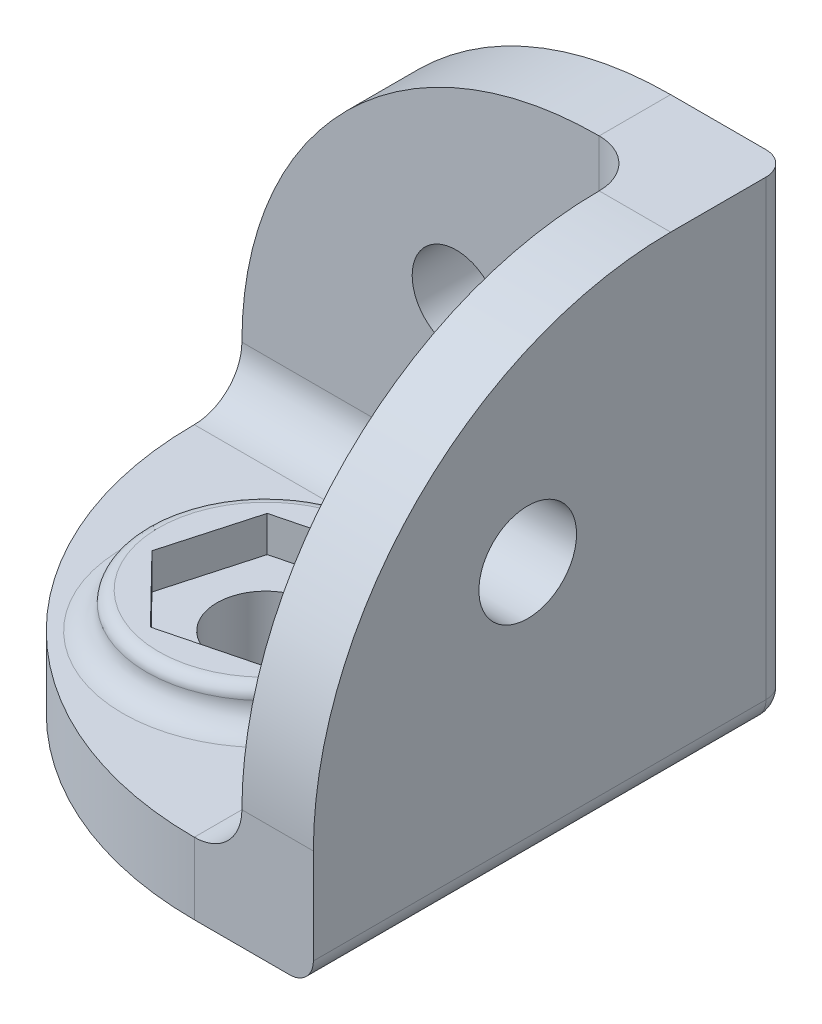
ISO-10303-21;
HEADER;
FILE_DESCRIPTION(('STEP AP214'),'2;1');
FILE_NAME('part.step','',(''),(''),'','','');
FILE_SCHEMA(('AUTOMOTIVE_DESIGN { 1 0 10303 214 1 1 1 1 }'));
ENDSEC;
DATA;
#1=APPLICATION_CONTEXT('core data for automotive mechanical design processes');
#2=APPLICATION_PROTOCOL_DEFINITION('international standard','automotive_design',2000,#1);
#3=PRODUCT_CONTEXT('',#1,'mechanical');
#4=PRODUCT('Part','Part','',(#3));
#5=PRODUCT_RELATED_PRODUCT_CATEGORY('part','',(#4));
#6=PRODUCT_DEFINITION_FORMATION('','',#4);
#7=PRODUCT_DEFINITION_CONTEXT('part definition',#1,'design');
#8=PRODUCT_DEFINITION('design','',#6,#7);
#9=PRODUCT_DEFINITION_SHAPE('','',#8);
#10=(LENGTH_UNIT() NAMED_UNIT(*) SI_UNIT(.MILLI.,.METRE.));
#11=(NAMED_UNIT(*) PLANE_ANGLE_UNIT() SI_UNIT($,.RADIAN.));
#12=(NAMED_UNIT(*) SI_UNIT($,.STERADIAN.) SOLID_ANGLE_UNIT());
#13=UNCERTAINTY_MEASURE_WITH_UNIT(LENGTH_MEASURE(1.E-05),#10,'distance_accuracy_value','');
#14=(GEOMETRIC_REPRESENTATION_CONTEXT(3) GLOBAL_UNCERTAINTY_ASSIGNED_CONTEXT((#13)) GLOBAL_UNIT_ASSIGNED_CONTEXT((#10,
#11,#12)) REPRESENTATION_CONTEXT('',''));
#15=CARTESIAN_POINT('',(0.,0.,0.));
#16=DIRECTION('',(0.,0.,1.));
#17=DIRECTION('',(1.,0.,0.));
#18=AXIS2_PLACEMENT_3D('',#15,#16,#17);
#19=CARTESIAN_POINT('',(2.23280034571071,3.,-2.83720930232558));
#20=DIRECTION('',(0.,1.,0.));
#21=DIRECTION('',(0.,0.,1.));
#22=AXIS2_PLACEMENT_3D('',#19,#20,#21);
#23=PLANE('',#22);
#24=DIRECTION('',(1.,0.,0.));
#25=VECTOR('',#24,1.);
#26=CARTESIAN_POINT('',(2.23280034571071,3.,-2.83720930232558));
#27=LINE('',#26,#25);
#28=CARTESIAN_POINT('',(2.23280034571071,3.,-2.83720930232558));
#29=VERTEX_POINT('',#28);
#30=CARTESIAN_POINT('',(-3.76719965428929,3.,-2.83720930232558));
#31=VERTEX_POINT('',#30);
#32=EDGE_CURVE('E305',#29,#31,#27,.F.);
#33=ORIENTED_EDGE('',*,*,#32,.T.);
#34=CARTESIAN_POINT('',(-3.76719965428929,3.,3.16279069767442));
#35=DIRECTION('',(0.,1.,0.));
#36=DIRECTION('',(0.,0.,1.));
#37=AXIS2_PLACEMENT_3D('',#34,#35,#36);
#38=CIRCLE('',#37,6.);
#39=CARTESIAN_POINT('',(2.23280034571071,3.,3.16279069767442));
#40=VERTEX_POINT('',#39);
#41=EDGE_CURVE('E329',#31,#40,#38,.F.);
#42=ORIENTED_EDGE('',*,*,#41,.T.);
#43=DIRECTION('',(0.,0.,1.));
#44=VECTOR('',#43,1.);
#45=CARTESIAN_POINT('',(2.23280034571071,3.,-2.83720930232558));
#46=LINE('',#45,#44);
#47=EDGE_CURVE('E308',#40,#29,#46,.F.);
#48=ORIENTED_EDGE('',*,*,#47,.T.);
#49=EDGE_LOOP('',(#33,#42,#48));
#50=FACE_BOUND('',#49,.T.);
#51=ADVANCED_FACE('F35',(#50),#23,.T.);
#52=CARTESIAN_POINT('',(2.23280034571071,3.,12.1627906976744));
#53=VERTEX_POINT('',#52);
#54=EDGE_CURVE('E309',#53,#40,#46,.F.);
#55=ORIENTED_EDGE('',*,*,#54,.T.);
#56=CARTESIAN_POINT('',(-3.76719965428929,3.,3.16279069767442));
#57=DIRECTION('',(0.,1.,0.));
#58=DIRECTION('',(0.,0.,1.));
#59=AXIS2_PLACEMENT_3D('',#56,#57,#58);
#60=CIRCLE('',#59,6.);
#61=EDGE_CURVE('E327',#40,#31,#60,.F.);
#62=ORIENTED_EDGE('',*,*,#61,.T.);
#63=CARTESIAN_POINT('',(-12.7671996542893,3.,-2.83720930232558));
#64=VERTEX_POINT('',#63);
#65=EDGE_CURVE('E304',#31,#64,#27,.F.);
#66=ORIENTED_EDGE('',*,*,#65,.T.);
#67=CARTESIAN_POINT('',(2.23280034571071,3.,-2.83720930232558));
#68=DIRECTION('',(0.,1.,0.));
#69=DIRECTION('',(0.,0.,1.));
#70=AXIS2_PLACEMENT_3D('',#67,#68,#69);
#71=CIRCLE('',#70,15.);
#72=EDGE_CURVE('E274',#64,#53,#71,.T.);
#73=ORIENTED_EDGE('',*,*,#72,.T.);
#74=EDGE_LOOP('',(#55,#62,#66,#73));
#75=FACE_BOUND('',#74,.T.);
#76=ADVANCED_FACE('F393',(#75),#23,.T.);
#77=DIRECTION('',(-0.968839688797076,0.,0.247688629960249));
#78=VECTOR('',#77,1.);
#79=CARTESIAN_POINT('',(-2.70751748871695,3.,-0.61747477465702));
#80=LINE('',#79,#78);
#81=CARTESIAN_POINT('',(-2.70751748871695,3.,-0.61747477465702));
#82=VERTEX_POINT('',#81);
#83=CARTESIAN_POINT('',(-6.51116450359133,3.,0.354946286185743));
#84=VERTEX_POINT('',#83);
#85=EDGE_CURVE('E204',#82,#84,#80,.T.);
#86=ORIENTED_EDGE('',*,*,#85,.T.);
#87=DIRECTION('',(-0.269915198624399,0.,0.962884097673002));
#88=VECTOR('',#87,1.);
#89=CARTESIAN_POINT('',(-6.51116450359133,3.,0.354946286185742));
#90=LINE('',#89,#88);
#91=CARTESIAN_POINT('',(-7.57084666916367,3.,4.13521175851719));
#92=VERTEX_POINT('',#91);
#93=EDGE_CURVE('E186',#84,#92,#90,.T.);
#94=ORIENTED_EDGE('',*,*,#93,.T.);
#95=DIRECTION('',(0.698924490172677,0.,0.715195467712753));
#96=VECTOR('',#95,1.);
#97=CARTESIAN_POINT('',(-7.57084666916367,3.,4.13521175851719));
#98=LINE('',#97,#96);
#99=CARTESIAN_POINT('',(-4.82688181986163,3.,6.94305617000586));
#100=VERTEX_POINT('',#99);
#101=EDGE_CURVE('E208',#92,#100,#98,.T.);
#102=ORIENTED_EDGE('',*,*,#101,.T.);
#103=DIRECTION('',(0.968839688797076,0.,-0.247688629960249));
#104=VECTOR('',#103,1.);
#105=CARTESIAN_POINT('',(-4.82688181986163,3.,6.94305617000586));
#106=LINE('',#105,#104);
#107=CARTESIAN_POINT('',(-1.02323480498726,3.,5.9706351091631));
#108=VERTEX_POINT('',#107);
#109=EDGE_CURVE('E210',#100,#108,#106,.T.);
#110=ORIENTED_EDGE('',*,*,#109,.T.);
#111=DIRECTION('',(0.269915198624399,0.,-0.962884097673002));
#112=VECTOR('',#111,1.);
#113=CARTESIAN_POINT('',(-1.02323480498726,3.,5.9706351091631));
#114=LINE('',#113,#112);
#115=CARTESIAN_POINT('',(0.0364473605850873,3.,2.19036963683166));
#116=VERTEX_POINT('',#115);
#117=EDGE_CURVE('E212',#108,#116,#114,.T.);
#118=ORIENTED_EDGE('',*,*,#117,.T.);
#119=DIRECTION('',(-0.698924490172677,0.,-0.715195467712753));
#120=VECTOR('',#119,1.);
#121=CARTESIAN_POINT('',(0.0364473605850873,3.,2.19036963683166));
#122=LINE('',#121,#120);
#123=EDGE_CURVE('E179',#116,#82,#122,.T.);
#124=ORIENTED_EDGE('',*,*,#123,.T.);
#125=EDGE_LOOP('',(#86,#94,#102,#110,#118,#124));
#126=FACE_BOUND('',#125,.T.);
#127=CARTESIAN_POINT('',(-3.76719965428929,3.,3.16279069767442));
#128=DIRECTION('',(0.,1.,0.));
#129=DIRECTION('',(0.,0.,1.));
#130=AXIS2_PLACEMENT_3D('',#127,#128,#129);
#131=CIRCLE('',#130,2.05);
#132=CARTESIAN_POINT('',(-3.76719965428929,3.,5.21279069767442));
#133=VERTEX_POINT('',#132);
#134=EDGE_CURVE('E268',#133,#133,#131,.T.);
#135=ORIENTED_EDGE('',*,*,#134,.F.);
#136=EDGE_LOOP('',(#135));
#137=FACE_BOUND('',#136,.T.);
#138=ADVANCED_FACE('F443',(#126,#137),#23,.T.);
#139=CARTESIAN_POINT('',(0.,0.,-4.83720930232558));
#140=DIRECTION('',(0.,0.,-1.));
#141=DIRECTION('',(-1.,0.,0.));
#142=AXIS2_PLACEMENT_3D('',#139,#140,#141);
#143=PLANE('',#142);
#144=CARTESIAN_POINT('',(-3.76719965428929,11.,-4.83720930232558));
#145=DIRECTION('',(0.,0.,-1.));
#146=DIRECTION('',(-1.,0.,0.));
#147=AXIS2_PLACEMENT_3D('',#144,#145,#146);
#148=CIRCLE('',#147,1.85136356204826);
#149=CARTESIAN_POINT('',(-5.61856321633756,11.,-4.83720930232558));
#150=VERTEX_POINT('',#149);
#151=EDGE_CURVE('E249',#150,#150,#148,.T.);
#152=ORIENTED_EDGE('',*,*,#151,.T.);
#153=EDGE_LOOP('',(#152));
#154=FACE_BOUND('',#153,.T.);
#155=DIRECTION('',(1.,0.,0.));
#156=VECTOR('',#155,1.);
#157=CARTESIAN_POINT('',(0.,5.,-4.83720930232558));
#158=LINE('',#157,#156);
#159=CARTESIAN_POINT('',(-12.7671996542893,5.,-4.83720930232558));
#160=VERTEX_POINT('',#159);
#161=CARTESIAN_POINT('',(2.23280034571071,5.,-4.83720930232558));
#162=VERTEX_POINT('',#161);
#163=EDGE_CURVE('E300',#160,#162,#158,.T.);
#164=ORIENTED_EDGE('',*,*,#163,.T.);
#165=DIRECTION('',(0.,-1.,0.));
#166=VECTOR('',#165,1.);
#167=CARTESIAN_POINT('',(2.23280034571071,20.,-4.83720930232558));
#168=LINE('',#167,#166);
#169=CARTESIAN_POINT('',(2.23280034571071,20.,-4.83720930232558));
#170=VERTEX_POINT('',#169);
#171=EDGE_CURVE('E302',#162,#170,#168,.F.);
#172=ORIENTED_EDGE('',*,*,#171,.T.);
#173=CARTESIAN_POINT('',(2.23280034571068,5.00000000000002,-4.83720930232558));
#174=DIRECTION('',(0.,0.,-1.));
#175=DIRECTION('',(-1.,0.,0.));
#176=AXIS2_PLACEMENT_3D('',#173,#174,#175);
#177=CIRCLE('',#176,15.);
#178=EDGE_CURVE('E246',#170,#160,#177,.F.);
#179=ORIENTED_EDGE('',*,*,#178,.T.);
#180=EDGE_LOOP('',(#164,#172,#179));
#181=FACE_BOUND('',#180,.T.);
#182=ADVANCED_FACE('F451',(#154,#181),#143,.F.);
#183=CARTESIAN_POINT('',(2.23280034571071,0.,-2.83720930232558));
#184=DIRECTION('',(0.,1.,0.));
#185=DIRECTION('',(0.,0.,1.));
#186=AXIS2_PLACEMENT_3D('',#183,#184,#185);
#187=PLANE('',#186);
#188=DIRECTION('',(-1.,0.,0.));
#189=VECTOR('',#188,1.);
#190=CARTESIAN_POINT('',(2.23280034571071,0.,-6.83720930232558));
#191=LINE('',#190,#189);
#192=CARTESIAN_POINT('',(-12.7671996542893,0.,-6.83720930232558));
#193=VERTEX_POINT('',#192);
#194=CARTESIAN_POINT('',(6.23280034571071,0.,-6.83720930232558));
#195=VERTEX_POINT('',#194);
#196=EDGE_CURVE('E337',#193,#195,#191,.F.);
#197=ORIENTED_EDGE('',*,*,#196,.T.);
#198=DIRECTION('',(0.,0.,-1.));
#199=VECTOR('',#198,1.);
#200=CARTESIAN_POINT('',(6.23280034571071,0.,-2.83720930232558));
#201=LINE('',#200,#199);
#202=CARTESIAN_POINT('',(6.23280034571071,0.,12.1627906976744));
#203=VERTEX_POINT('',#202);
#204=EDGE_CURVE('E339',#195,#203,#201,.F.);
#205=ORIENTED_EDGE('',*,*,#204,.T.);
#206=DIRECTION('',(1.,0.,0.));
#207=VECTOR('',#206,1.);
#208=CARTESIAN_POINT('',(7.23280034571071,0.,12.1627906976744));
#209=LINE('',#208,#207);
#210=CARTESIAN_POINT('',(2.23280034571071,0.,12.1627906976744));
#211=VERTEX_POINT('',#210);
#212=EDGE_CURVE('E278',#211,#203,#209,.T.);
#213=ORIENTED_EDGE('',*,*,#212,.F.);
#214=CARTESIAN_POINT('',(2.23280034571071,0.,-2.83720930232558));
#215=DIRECTION('',(0.,1.,0.));
#216=DIRECTION('',(0.,0.,1.));
#217=AXIS2_PLACEMENT_3D('',#214,#215,#216);
#218=CIRCLE('',#217,15.);
#219=CARTESIAN_POINT('',(-12.7671996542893,0.,-2.83720930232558));
#220=VERTEX_POINT('',#219);
#221=EDGE_CURVE('E280',#220,#211,#218,.T.);
#222=ORIENTED_EDGE('',*,*,#221,.F.);
#223=DIRECTION('',(0.,0.,1.));
#224=VECTOR('',#223,1.);
#225=CARTESIAN_POINT('',(-12.7671996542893,0.,-2.83720930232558));
#226=LINE('',#225,#224);
#227=EDGE_CURVE('E271',#193,#220,#226,.T.);
#228=ORIENTED_EDGE('',*,*,#227,.F.);
#229=EDGE_LOOP('',(#197,#205,#213,#222,#228));
#230=FACE_BOUND('',#229,.T.);
#231=CARTESIAN_POINT('',(-3.76719965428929,0.,3.16279069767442));
#232=DIRECTION('',(0.,1.,0.));
#233=DIRECTION('',(0.,0.,1.));
#234=AXIS2_PLACEMENT_3D('',#231,#232,#233);
#235=CIRCLE('',#234,2.05);
#236=CARTESIAN_POINT('',(-3.76719965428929,0.,5.21279069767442));
#237=VERTEX_POINT('',#236);
#238=EDGE_CURVE('E263',#237,#237,#235,.T.);
#239=ORIENTED_EDGE('',*,*,#238,.T.);
#240=EDGE_LOOP('',(#239));
#241=FACE_BOUND('',#240,.T.);
#242=ADVANCED_FACE('F372',(#230,#241),#187,.F.);
#243=CARTESIAN_POINT('',(7.23280034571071,3.,-7.83720930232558));
#244=DIRECTION('',(-1.,0.,0.));
#245=DIRECTION('',(0.,0.,1.));
#246=AXIS2_PLACEMENT_3D('',#243,#244,#245);
#247=PLANE('',#246);
#248=DIRECTION('',(0.,-1.,0.));
#249=VECTOR('',#248,1.);
#250=CARTESIAN_POINT('',(7.23280034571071,3.,12.1627906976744));
#251=LINE('',#250,#249);
#252=CARTESIAN_POINT('',(7.23280034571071,5.,12.1627906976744));
#253=VERTEX_POINT('',#252);
#254=CARTESIAN_POINT('',(7.23280034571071,1.,12.1627906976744));
#255=VERTEX_POINT('',#254);
#256=EDGE_CURVE('E277',#253,#255,#251,.T.);
#257=ORIENTED_EDGE('',*,*,#256,.T.);
#258=DIRECTION('',(0.,0.,-1.));
#259=VECTOR('',#258,1.);
#260=CARTESIAN_POINT('',(7.23280034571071,1.,-7.83720930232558));
#261=LINE('',#260,#259);
#262=CARTESIAN_POINT('',(7.23280034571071,1.,-6.83720930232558));
#263=VERTEX_POINT('',#262);
#264=EDGE_CURVE('E334',#255,#263,#261,.T.);
#265=ORIENTED_EDGE('',*,*,#264,.T.);
#266=DIRECTION('',(0.,-1.,0.));
#267=VECTOR('',#266,1.);
#268=CARTESIAN_POINT('',(7.23280034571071,3.,-6.83720930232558));
#269=LINE('',#268,#267);
#270=CARTESIAN_POINT('',(7.23280034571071,20.,-6.83720930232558));
#271=VERTEX_POINT('',#270);
#272=EDGE_CURVE('E332',#263,#271,#269,.F.);
#273=ORIENTED_EDGE('',*,*,#272,.T.);
#274=DIRECTION('',(0.,0.,-1.));
#275=VECTOR('',#274,1.);
#276=CARTESIAN_POINT('',(7.23280034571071,20.,-4.83720930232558));
#277=LINE('',#276,#275);
#278=CARTESIAN_POINT('',(7.23280034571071,20.,-2.83720930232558));
#279=VERTEX_POINT('',#278);
#280=EDGE_CURVE('E264',#279,#271,#277,.T.);
#281=ORIENTED_EDGE('',*,*,#280,.F.);
#282=CARTESIAN_POINT('',(7.23280034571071,4.99999999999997,-2.83720930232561));
#283=DIRECTION('',(1.,0.,0.));
#284=DIRECTION('',(0.,0.,-1.));
#285=AXIS2_PLACEMENT_3D('',#282,#283,#284);
#286=CIRCLE('',#285,15.);
#287=EDGE_CURVE('E234',#253,#279,#286,.F.);
#288=ORIENTED_EDGE('',*,*,#287,.F.);
#289=EDGE_LOOP('',(#257,#265,#273,#281,#288));
#290=FACE_BOUND('',#289,.T.);
#291=CARTESIAN_POINT('',(7.23280034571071,11.,3.16279069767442));
#292=DIRECTION('',(1.,0.,0.));
#293=DIRECTION('',(0.,0.,-1.));
#294=AXIS2_PLACEMENT_3D('',#291,#292,#293);
#295=CIRCLE('',#294,2.05);
#296=CARTESIAN_POINT('',(7.23280034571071,11.,1.11279069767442));
#297=VERTEX_POINT('',#296);
#298=EDGE_CURVE('E230',#297,#297,#295,.T.);
#299=ORIENTED_EDGE('',*,*,#298,.F.);
#300=EDGE_LOOP('',(#299));
#301=FACE_BOUND('',#300,.T.);
#302=ADVANCED_FACE('F363',(#290,#301),#247,.F.);
#303=CARTESIAN_POINT('',(-12.7671996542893,3.,-7.83720930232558));
#304=DIRECTION('',(0.,0.,1.));
#305=DIRECTION('',(1.,0.,0.));
#306=AXIS2_PLACEMENT_3D('',#303,#304,#305);
#307=PLANE('',#306);
#308=DIRECTION('',(-1.,0.,0.));
#309=VECTOR('',#308,1.);
#310=CARTESIAN_POINT('',(0.,20.,-7.83720930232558));
#311=LINE('',#310,#309);
#312=CARTESIAN_POINT('',(6.23280034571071,20.,-7.83720930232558));
#313=VERTEX_POINT('',#312);
#314=CARTESIAN_POINT('',(2.23280034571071,20.,-7.83720930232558));
#315=VERTEX_POINT('',#314);
#316=EDGE_CURVE('E256',#313,#315,#311,.T.);
#317=ORIENTED_EDGE('',*,*,#316,.F.);
#318=DIRECTION('',(0.,-1.,0.));
#319=VECTOR('',#318,1.);
#320=CARTESIAN_POINT('',(6.23280034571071,3.,-7.83720930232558));
#321=LINE('',#320,#319);
#322=CARTESIAN_POINT('',(6.23280034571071,1.,-7.83720930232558));
#323=VERTEX_POINT('',#322);
#324=EDGE_CURVE('E50',#313,#323,#321,.T.);
#325=ORIENTED_EDGE('',*,*,#324,.T.);
#326=DIRECTION('',(-1.,0.,0.));
#327=VECTOR('',#326,1.);
#328=CARTESIAN_POINT('',(-12.7671996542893,1.,-7.83720930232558));
#329=LINE('',#328,#327);
#330=CARTESIAN_POINT('',(-12.7671996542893,1.,-7.83720930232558));
#331=VERTEX_POINT('',#330);
#332=EDGE_CURVE('E343',#323,#331,#329,.T.);
#333=ORIENTED_EDGE('',*,*,#332,.T.);
#334=DIRECTION('',(0.,-1.,0.));
#335=VECTOR('',#334,1.);
#336=CARTESIAN_POINT('',(-12.7671996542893,3.,-7.83720930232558));
#337=LINE('',#336,#335);
#338=CARTESIAN_POINT('',(-12.7671996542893,5.,-7.83720930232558));
#339=VERTEX_POINT('',#338);
#340=EDGE_CURVE('E292',#339,#331,#337,.T.);
#341=ORIENTED_EDGE('',*,*,#340,.F.);
#342=CARTESIAN_POINT('',(2.23280034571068,5.00000000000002,-7.83720930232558));
#343=DIRECTION('',(0.,0.,-1.));
#344=DIRECTION('',(-1.,0.,0.));
#345=AXIS2_PLACEMENT_3D('',#342,#343,#344);
#346=CIRCLE('',#345,15.);
#347=EDGE_CURVE('E243',#315,#339,#346,.F.);
#348=ORIENTED_EDGE('',*,*,#347,.F.);
#349=EDGE_LOOP('',(#317,#325,#333,#341,#348));
#350=FACE_BOUND('',#349,.T.);
#351=CARTESIAN_POINT('',(-3.76719965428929,11.,-7.83720930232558));
#352=DIRECTION('',(0.,0.,-1.));
#353=DIRECTION('',(-1.,0.,0.));
#354=AXIS2_PLACEMENT_3D('',#351,#352,#353);
#355=CIRCLE('',#354,1.85136356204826);
#356=CARTESIAN_POINT('',(-5.61856321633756,11.,-7.83720930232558));
#357=VERTEX_POINT('',#356);
#358=EDGE_CURVE('E250',#357,#357,#355,.T.);
#359=ORIENTED_EDGE('',*,*,#358,.F.);
#360=EDGE_LOOP('',(#359));
#361=FACE_BOUND('',#360,.T.);
#362=ADVANCED_FACE('F403',(#350,#361),#307,.F.);
#363=CARTESIAN_POINT('',(-12.7671996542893,3.,-2.83720930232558));
#364=DIRECTION('',(1.,0.,0.));
#365=DIRECTION('',(0.,0.,-1.));
#366=AXIS2_PLACEMENT_3D('',#363,#364,#365);
#367=PLANE('',#366);
#368=ORIENTED_EDGE('',*,*,#340,.T.);
#369=CARTESIAN_POINT('',(-12.7671996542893,1.,-6.83720930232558));
#370=DIRECTION('',(1.,0.,0.));
#371=DIRECTION('',(0.,0.,-1.));
#372=AXIS2_PLACEMENT_3D('',#369,#370,#371);
#373=CIRCLE('',#372,1.);
#374=EDGE_CURVE('E43',#331,#193,#373,.F.);
#375=ORIENTED_EDGE('',*,*,#374,.T.);
#376=ORIENTED_EDGE('',*,*,#227,.T.);
#377=DIRECTION('',(0.,-1.,0.));
#378=VECTOR('',#377,1.);
#379=CARTESIAN_POINT('',(-12.7671996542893,3.,-2.83720930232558));
#380=LINE('',#379,#378);
#381=EDGE_CURVE('E289',#64,#220,#380,.T.);
#382=ORIENTED_EDGE('',*,*,#381,.F.);
#383=CARTESIAN_POINT('',(-12.7671996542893,5.,-2.83720930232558));
#384=DIRECTION('',(1.,0.,0.));
#385=DIRECTION('',(0.,0.,-1.));
#386=AXIS2_PLACEMENT_3D('',#383,#384,#385);
#387=CIRCLE('',#386,2.);
#388=EDGE_CURVE('E316',#64,#160,#387,.T.);
#389=ORIENTED_EDGE('',*,*,#388,.T.);
#390=DIRECTION('',(0.,0.,-1.));
#391=VECTOR('',#390,1.);
#392=CARTESIAN_POINT('',(-12.7671996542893,5.,-4.83720930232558));
#393=LINE('',#392,#391);
#394=EDGE_CURVE('E260',#160,#339,#393,.T.);
#395=ORIENTED_EDGE('',*,*,#394,.T.);
#396=EDGE_LOOP('',(#368,#375,#376,#382,#389,#395));
#397=FACE_BOUND('',#396,.T.);
#398=ADVANCED_FACE('F399',(#397),#367,.F.);
#399=CARTESIAN_POINT('',(2.23280034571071,3.,-2.83720930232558));
#400=DIRECTION('',(0.,-1.,0.));
#401=DIRECTION('',(0.,0.,-1.));
#402=AXIS2_PLACEMENT_3D('',#399,#400,#401);
#403=CYLINDRICAL_SURFACE('',#402,15.);
#404=ORIENTED_EDGE('',*,*,#221,.T.);
#405=DIRECTION('',(0.,-1.,0.));
#406=VECTOR('',#405,1.);
#407=CARTESIAN_POINT('',(2.23280034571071,3.,12.1627906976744));
#408=LINE('',#407,#406);
#409=EDGE_CURVE('E286',#53,#211,#408,.T.);
#410=ORIENTED_EDGE('',*,*,#409,.F.);
#411=ORIENTED_EDGE('',*,*,#72,.F.);
#412=ORIENTED_EDGE('',*,*,#381,.T.);
#413=EDGE_LOOP('',(#404,#410,#411,#412));
#414=FACE_BOUND('',#413,.T.);
#415=ADVANCED_FACE('F385',(#414),#403,.T.);
#416=CARTESIAN_POINT('',(7.23280034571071,3.,12.1627906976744));
#417=DIRECTION('',(0.,0.,-1.));
#418=DIRECTION('',(-1.,0.,0.));
#419=AXIS2_PLACEMENT_3D('',#416,#417,#418);
#420=PLANE('',#419);
#421=ORIENTED_EDGE('',*,*,#212,.T.);
#422=CARTESIAN_POINT('',(6.23280034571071,1.,12.1627906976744));
#423=DIRECTION('',(0.,0.,-1.));
#424=DIRECTION('',(-1.,0.,0.));
#425=AXIS2_PLACEMENT_3D('',#422,#423,#424);
#426=CIRCLE('',#425,1.);
#427=EDGE_CURVE('E341',#203,#255,#426,.F.);
#428=ORIENTED_EDGE('',*,*,#427,.T.);
#429=ORIENTED_EDGE('',*,*,#256,.F.);
#430=DIRECTION('',(1.,0.,0.));
#431=VECTOR('',#430,1.);
#432=CARTESIAN_POINT('',(4.23280034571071,5.,12.1627906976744));
#433=LINE('',#432,#431);
#434=CARTESIAN_POINT('',(4.23280034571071,5.,12.1627906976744));
#435=VERTEX_POINT('',#434);
#436=EDGE_CURVE('E233',#435,#253,#433,.T.);
#437=ORIENTED_EDGE('',*,*,#436,.F.);
#438=CARTESIAN_POINT('',(2.23280034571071,5.,12.1627906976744));
#439=DIRECTION('',(0.,0.,-1.));
#440=DIRECTION('',(-1.,0.,0.));
#441=AXIS2_PLACEMENT_3D('',#438,#439,#440);
#442=CIRCLE('',#441,2.);
#443=EDGE_CURVE('E314',#435,#53,#442,.T.);
#444=ORIENTED_EDGE('',*,*,#443,.T.);
#445=ORIENTED_EDGE('',*,*,#409,.T.);
#446=EDGE_LOOP('',(#421,#428,#429,#437,#444,#445));
#447=FACE_BOUND('',#446,.T.);
#448=ADVANCED_FACE('F378',(#447),#420,.F.);
#449=CARTESIAN_POINT('',(-3.76719965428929,3.,3.16279069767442));
#450=DIRECTION('',(0.,-1.,0.));
#451=DIRECTION('',(0.,0.,-1.));
#452=AXIS2_PLACEMENT_3D('',#449,#450,#451);
#453=CYLINDRICAL_SURFACE('',#452,2.05);
#454=ORIENTED_EDGE('',*,*,#134,.T.);
#455=EDGE_LOOP('',(#454));
#456=FACE_BOUND('',#455,.T.);
#457=ORIENTED_EDGE('',*,*,#238,.F.);
#458=EDGE_LOOP('',(#457));
#459=FACE_BOUND('',#458,.T.);
#460=ADVANCED_FACE('F462',(#456,#459),#453,.F.);
#461=CARTESIAN_POINT('',(2.23280034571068,5.00000000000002,-4.83720930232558));
#462=DIRECTION('',(0.,0.,-1.));
#463=DIRECTION('',(-1.,0.,0.));
#464=AXIS2_PLACEMENT_3D('',#461,#462,#463);
#465=CYLINDRICAL_SURFACE('',#464,15.);
#466=ORIENTED_EDGE('',*,*,#347,.T.);
#467=ORIENTED_EDGE('',*,*,#394,.F.);
#468=ORIENTED_EDGE('',*,*,#178,.F.);
#469=DIRECTION('',(0.,0.,-1.));
#470=VECTOR('',#469,1.);
#471=CARTESIAN_POINT('',(2.23280034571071,20.,-4.83720930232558));
#472=LINE('',#471,#470);
#473=EDGE_CURVE('E253',#170,#315,#472,.T.);
#474=ORIENTED_EDGE('',*,*,#473,.T.);
#475=EDGE_LOOP('',(#466,#467,#468,#474));
#476=FACE_BOUND('',#475,.T.);
#477=ADVANCED_FACE('F410',(#476),#465,.T.);
#478=CARTESIAN_POINT('',(0.,20.,-4.83720930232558));
#479=DIRECTION('',(0.,-1.,0.));
#480=DIRECTION('',(0.,0.,-1.));
#481=AXIS2_PLACEMENT_3D('',#478,#479,#480);
#482=PLANE('',#481);
#483=ORIENTED_EDGE('',*,*,#280,.T.);
#484=CARTESIAN_POINT('',(6.23280034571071,20.,-6.83720930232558));
#485=DIRECTION('',(0.,-1.,0.));
#486=DIRECTION('',(0.,0.,-1.));
#487=AXIS2_PLACEMENT_3D('',#484,#485,#486);
#488=CIRCLE('',#487,1.);
#489=EDGE_CURVE('E58',#271,#313,#488,.F.);
#490=ORIENTED_EDGE('',*,*,#489,.T.);
#491=ORIENTED_EDGE('',*,*,#316,.T.);
#492=ORIENTED_EDGE('',*,*,#473,.F.);
#493=CARTESIAN_POINT('',(2.23280034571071,20.,-2.83720930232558));
#494=DIRECTION('',(0.,-1.,0.));
#495=DIRECTION('',(0.,0.,-1.));
#496=AXIS2_PLACEMENT_3D('',#493,#494,#495);
#497=CIRCLE('',#496,2.);
#498=CARTESIAN_POINT('',(4.23280034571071,20.,-2.83720930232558));
#499=VERTEX_POINT('',#498);
#500=EDGE_CURVE('E312',#170,#499,#497,.T.);
#501=ORIENTED_EDGE('',*,*,#500,.T.);
#502=DIRECTION('',(1.,0.,0.));
#503=VECTOR('',#502,1.);
#504=CARTESIAN_POINT('',(4.23280034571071,20.,-2.83720930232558));
#505=LINE('',#504,#503);
#506=EDGE_CURVE('E240',#499,#279,#505,.T.);
#507=ORIENTED_EDGE('',*,*,#506,.T.);
#508=EDGE_LOOP('',(#483,#490,#491,#492,#501,#507));
#509=FACE_BOUND('',#508,.T.);
#510=ADVANCED_FACE('F412',(#509),#482,.F.);
#511=CARTESIAN_POINT('',(-3.76719965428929,11.,-4.83720930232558));
#512=DIRECTION('',(0.,0.,-1.));
#513=DIRECTION('',(-1.,0.,0.));
#514=AXIS2_PLACEMENT_3D('',#511,#512,#513);
#515=CYLINDRICAL_SURFACE('',#514,1.85136356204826);
#516=ORIENTED_EDGE('',*,*,#151,.F.);
#517=EDGE_LOOP('',(#516));
#518=FACE_BOUND('',#517,.T.);
#519=ORIENTED_EDGE('',*,*,#358,.T.);
#520=EDGE_LOOP('',(#519));
#521=FACE_BOUND('',#520,.T.);
#522=ADVANCED_FACE('F429',(#518,#521),#515,.F.);
#523=CARTESIAN_POINT('',(4.23280034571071,4.99999999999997,-2.83720930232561));
#524=DIRECTION('',(1.,0.,0.));
#525=DIRECTION('',(0.,0.,-1.));
#526=AXIS2_PLACEMENT_3D('',#523,#524,#525);
#527=CYLINDRICAL_SURFACE('',#526,15.);
#528=ORIENTED_EDGE('',*,*,#287,.T.);
#529=ORIENTED_EDGE('',*,*,#506,.F.);
#530=CARTESIAN_POINT('',(4.23280034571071,4.99999999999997,-2.83720930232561));
#531=DIRECTION('',(1.,0.,0.));
#532=DIRECTION('',(0.,0.,-1.));
#533=AXIS2_PLACEMENT_3D('',#530,#531,#532);
#534=CIRCLE('',#533,15.);
#535=EDGE_CURVE('E226',#435,#499,#534,.F.);
#536=ORIENTED_EDGE('',*,*,#535,.F.);
#537=ORIENTED_EDGE('',*,*,#436,.T.);
#538=EDGE_LOOP('',(#528,#529,#536,#537));
#539=FACE_BOUND('',#538,.T.);
#540=ADVANCED_FACE('F426',(#539),#527,.T.);
#541=CARTESIAN_POINT('',(4.23280034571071,11.,3.16279069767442));
#542=DIRECTION('',(1.,0.,0.));
#543=DIRECTION('',(0.,0.,-1.));
#544=AXIS2_PLACEMENT_3D('',#541,#542,#543);
#545=CYLINDRICAL_SURFACE('',#544,2.05);
#546=CARTESIAN_POINT('',(4.23280034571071,11.,3.16279069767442));
#547=DIRECTION('',(1.,0.,0.));
#548=DIRECTION('',(0.,0.,-1.));
#549=AXIS2_PLACEMENT_3D('',#546,#547,#548);
#550=CIRCLE('',#549,2.05);
#551=CARTESIAN_POINT('',(4.23280034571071,11.,1.11279069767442));
#552=VERTEX_POINT('',#551);
#553=EDGE_CURVE('E229',#552,#552,#550,.T.);
#554=ORIENTED_EDGE('',*,*,#553,.F.);
#555=EDGE_LOOP('',(#554));
#556=FACE_BOUND('',#555,.T.);
#557=ORIENTED_EDGE('',*,*,#298,.T.);
#558=EDGE_LOOP('',(#557));
#559=FACE_BOUND('',#558,.T.);
#560=ADVANCED_FACE('F428',(#556,#559),#545,.F.);
#561=CARTESIAN_POINT('',(4.23280034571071,0.,0.));
#562=DIRECTION('',(1.,0.,0.));
#563=DIRECTION('',(0.,0.,-1.));
#564=AXIS2_PLACEMENT_3D('',#561,#562,#563);
#565=PLANE('',#564);
#566=ORIENTED_EDGE('',*,*,#535,.T.);
#567=DIRECTION('',(0.,-1.,0.));
#568=VECTOR('',#567,1.);
#569=CARTESIAN_POINT('',(4.23280034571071,3.,-2.83720930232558));
#570=LINE('',#569,#568);
#571=CARTESIAN_POINT('',(4.23280034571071,5.,-2.83720930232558));
#572=VERTEX_POINT('',#571);
#573=EDGE_CURVE('E297',#499,#572,#570,.T.);
#574=ORIENTED_EDGE('',*,*,#573,.T.);
#575=DIRECTION('',(0.,0.,1.));
#576=VECTOR('',#575,1.);
#577=CARTESIAN_POINT('',(4.23280034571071,5.,0.));
#578=LINE('',#577,#576);
#579=EDGE_CURVE('E295',#572,#435,#578,.T.);
#580=ORIENTED_EDGE('',*,*,#579,.T.);
#581=EDGE_LOOP('',(#566,#574,#580));
#582=FACE_BOUND('',#581,.T.);
#583=ORIENTED_EDGE('',*,*,#553,.T.);
#584=EDGE_LOOP('',(#583));
#585=FACE_BOUND('',#584,.T.);
#586=ADVANCED_FACE('F421',(#582,#585),#565,.F.);
#587=CARTESIAN_POINT('',(2.23280034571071,5.,0.));
#588=DIRECTION('',(0.,0.,1.));
#589=DIRECTION('',(1.,0.,0.));
#590=AXIS2_PLACEMENT_3D('',#587,#588,#589);
#591=CYLINDRICAL_SURFACE('',#590,2.);
#592=ORIENTED_EDGE('',*,*,#443,.F.);
#593=ORIENTED_EDGE('',*,*,#579,.F.);
#594=CARTESIAN_POINT('',(2.23280034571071,5.,-2.83720930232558));
#595=DIRECTION('',(0.,0.,1.));
#596=DIRECTION('',(1.,0.,0.));
#597=AXIS2_PLACEMENT_3D('',#594,#595,#596);
#598=CIRCLE('',#597,2.);
#599=EDGE_CURVE('E237',#29,#572,#598,.T.);
#600=ORIENTED_EDGE('',*,*,#599,.F.);
#601=ORIENTED_EDGE('',*,*,#47,.F.);
#602=ORIENTED_EDGE('',*,*,#54,.F.);
#603=EDGE_LOOP('',(#592,#593,#600,#601,#602));
#604=FACE_BOUND('',#603,.T.);
#605=ADVANCED_FACE('F389',(#604),#591,.F.);
#606=CARTESIAN_POINT('',(0.,5.,-2.83720930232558));
#607=DIRECTION('',(1.,0.,0.));
#608=DIRECTION('',(0.,0.,-1.));
#609=AXIS2_PLACEMENT_3D('',#606,#607,#608);
#610=CYLINDRICAL_SURFACE('',#609,2.);
#611=ORIENTED_EDGE('',*,*,#388,.F.);
#612=ORIENTED_EDGE('',*,*,#65,.F.);
#613=ORIENTED_EDGE('',*,*,#32,.F.);
#614=CARTESIAN_POINT('',(2.23280034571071,5.,-2.83720930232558));
#615=DIRECTION('',(-1.,0.,0.));
#616=DIRECTION('',(0.,0.,1.));
#617=AXIS2_PLACEMENT_3D('',#614,#615,#616);
#618=CIRCLE('',#617,2.);
#619=EDGE_CURVE('E320',#162,#29,#618,.T.);
#620=ORIENTED_EDGE('',*,*,#619,.F.);
#621=ORIENTED_EDGE('',*,*,#163,.F.);
#622=EDGE_LOOP('',(#611,#612,#613,#620,#621));
#623=FACE_BOUND('',#622,.T.);
#624=ADVANCED_FACE('F486',(#623),#610,.F.);
#625=CARTESIAN_POINT('',(2.23280034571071,5.,-2.83720930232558));
#626=DIRECTION('',(0.,0.,1.));
#627=DIRECTION('',(1.,0.,0.));
#628=AXIS2_PLACEMENT_3D('',#625,#626,#627);
#629=SPHERICAL_SURFACE('',#628,2.);
#630=ORIENTED_EDGE('',*,*,#619,.T.);
#631=ORIENTED_EDGE('',*,*,#599,.T.);
#632=CARTESIAN_POINT('',(2.23280034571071,5.,-2.83720930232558));
#633=DIRECTION('',(0.,1.,0.));
#634=DIRECTION('',(0.,0.,1.));
#635=AXIS2_PLACEMENT_3D('',#632,#633,#634);
#636=CIRCLE('',#635,2.);
#637=EDGE_CURVE('E187',#162,#572,#636,.F.);
#638=ORIENTED_EDGE('',*,*,#637,.F.);
#639=EDGE_LOOP('',(#630,#631,#638));
#640=FACE_BOUND('',#639,.T.);
#641=ADVANCED_FACE('F483',(#640),#629,.F.);
#642=CARTESIAN_POINT('',(2.23280034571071,0.,-2.83720930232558));
#643=DIRECTION('',(0.,1.,0.));
#644=DIRECTION('',(-1.,0.,0.));
#645=AXIS2_PLACEMENT_3D('',#642,#643,#644);
#646=CYLINDRICAL_SURFACE('',#645,2.);
#647=ORIENTED_EDGE('',*,*,#500,.F.);
#648=ORIENTED_EDGE('',*,*,#171,.F.);
#649=ORIENTED_EDGE('',*,*,#637,.T.);
#650=ORIENTED_EDGE('',*,*,#573,.F.);
#651=EDGE_LOOP('',(#647,#648,#649,#650));
#652=FACE_BOUND('',#651,.T.);
#653=ADVANCED_FACE('F418',(#652),#646,.F.);
#654=CARTESIAN_POINT('',(-3.76719965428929,4.5,3.16279069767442));
#655=DIRECTION('',(0.,1.,0.));
#656=DIRECTION('',(0.,0.,1.));
#657=AXIS2_PLACEMENT_3D('',#654,#655,#656);
#658=PLANE('',#657);
#659=CARTESIAN_POINT('',(-3.76719965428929,4.5,3.16279069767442));
#660=DIRECTION('',(0.,1.,0.));
#661=DIRECTION('',(0.,0.,1.));
#662=AXIS2_PLACEMENT_3D('',#659,#660,#661);
#663=CIRCLE('',#662,4.5);
#664=CARTESIAN_POINT('',(-3.76719965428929,4.5,7.66279069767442));
#665=VERTEX_POINT('',#664);
#666=EDGE_CURVE('E11',#665,#665,#663,.T.);
#667=ORIENTED_EDGE('',*,*,#666,.T.);
#668=EDGE_LOOP('',(#667));
#669=FACE_BOUND('',#668,.T.);
#670=DIRECTION('',(-0.269915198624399,0.,0.962884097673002));
#671=VECTOR('',#670,1.);
#672=CARTESIAN_POINT('',(-6.51116450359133,4.5,0.354946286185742));
#673=LINE('',#672,#671);
#674=CARTESIAN_POINT('',(-6.51116450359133,4.5,0.354946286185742));
#675=VERTEX_POINT('',#674);
#676=CARTESIAN_POINT('',(-7.57084666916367,4.5,4.13521175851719));
#677=VERTEX_POINT('',#676);
#678=EDGE_CURVE('E178',#675,#677,#673,.T.);
#679=ORIENTED_EDGE('',*,*,#678,.F.);
#680=DIRECTION('',(-0.968839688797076,0.,0.247688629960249));
#681=VECTOR('',#680,1.);
#682=CARTESIAN_POINT('',(-2.70751748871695,4.5,-0.61747477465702));
#683=LINE('',#682,#681);
#684=CARTESIAN_POINT('',(-2.70751748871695,4.5,-0.61747477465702));
#685=VERTEX_POINT('',#684);
#686=EDGE_CURVE('E168',#685,#675,#683,.T.);
#687=ORIENTED_EDGE('',*,*,#686,.F.);
#688=DIRECTION('',(-0.698924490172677,0.,-0.715195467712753));
#689=VECTOR('',#688,1.);
#690=CARTESIAN_POINT('',(0.0364473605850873,4.5,2.19036963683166));
#691=LINE('',#690,#689);
#692=CARTESIAN_POINT('',(0.036447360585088,4.5,2.19036963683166));
#693=VERTEX_POINT('',#692);
#694=EDGE_CURVE('E202',#693,#685,#691,.T.);
#695=ORIENTED_EDGE('',*,*,#694,.F.);
#696=DIRECTION('',(0.269915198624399,0.,-0.962884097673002));
#697=VECTOR('',#696,1.);
#698=CARTESIAN_POINT('',(-1.02323480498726,4.5,5.9706351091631));
#699=LINE('',#698,#697);
#700=CARTESIAN_POINT('',(-1.02323480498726,4.5,5.9706351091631));
#701=VERTEX_POINT('',#700);
#702=EDGE_CURVE('E199',#701,#693,#699,.T.);
#703=ORIENTED_EDGE('',*,*,#702,.F.);
#704=DIRECTION('',(0.968839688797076,0.,-0.247688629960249));
#705=VECTOR('',#704,1.);
#706=CARTESIAN_POINT('',(-4.82688181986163,4.5,6.94305617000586));
#707=LINE('',#706,#705);
#708=CARTESIAN_POINT('',(-4.82688181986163,4.5,6.94305617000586));
#709=VERTEX_POINT('',#708);
#710=EDGE_CURVE('E195',#709,#701,#707,.T.);
#711=ORIENTED_EDGE('',*,*,#710,.F.);
#712=DIRECTION('',(0.698924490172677,0.,0.715195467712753));
#713=VECTOR('',#712,1.);
#714=CARTESIAN_POINT('',(-7.57084666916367,4.5,4.13521175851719));
#715=LINE('',#714,#713);
#716=EDGE_CURVE('E193',#677,#709,#715,.T.);
#717=ORIENTED_EDGE('',*,*,#716,.F.);
#718=EDGE_LOOP('',(#679,#687,#695,#703,#711,#717));
#719=FACE_BOUND('',#718,.T.);
#720=ADVANCED_FACE('F191',(#669,#719),#658,.T.);
#721=CARTESIAN_POINT('',(-2.70751748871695,4.5,-0.61747477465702));
#722=DIRECTION('',(0.247688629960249,0.,0.968839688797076));
#723=DIRECTION('',(0.968839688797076,0.,-0.247688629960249));
#724=AXIS2_PLACEMENT_3D('',#721,#722,#723);
#725=PLANE('',#724);
#726=ORIENTED_EDGE('',*,*,#85,.F.);
#727=DIRECTION('',(0.,-1.,0.));
#728=VECTOR('',#727,1.);
#729=CARTESIAN_POINT('',(-2.70751748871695,4.5,-0.61747477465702));
#730=LINE('',#729,#728);
#731=EDGE_CURVE('E174',#685,#82,#730,.T.);
#732=ORIENTED_EDGE('',*,*,#731,.F.);
#733=ORIENTED_EDGE('',*,*,#686,.T.);
#734=DIRECTION('',(0.,-1.,0.));
#735=VECTOR('',#734,1.);
#736=CARTESIAN_POINT('',(-6.51116450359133,4.5,0.354946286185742));
#737=LINE('',#736,#735);
#738=EDGE_CURVE('E172',#675,#84,#737,.T.);
#739=ORIENTED_EDGE('',*,*,#738,.T.);
#740=EDGE_LOOP('',(#726,#732,#733,#739));
#741=FACE_BOUND('',#740,.T.);
#742=ADVANCED_FACE('F171',(#741),#725,.T.);
#743=CARTESIAN_POINT('',(-6.51116450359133,4.5,0.354946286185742));
#744=DIRECTION('',(0.962884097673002,0.,0.269915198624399));
#745=DIRECTION('',(0.269915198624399,0.,-0.962884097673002));
#746=AXIS2_PLACEMENT_3D('',#743,#744,#745);
#747=PLANE('',#746);
#748=ORIENTED_EDGE('',*,*,#93,.F.);
#749=ORIENTED_EDGE('',*,*,#738,.F.);
#750=ORIENTED_EDGE('',*,*,#678,.T.);
#751=DIRECTION('',(0.,-1.,0.));
#752=VECTOR('',#751,1.);
#753=CARTESIAN_POINT('',(-7.57084666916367,4.5,4.13521175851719));
#754=LINE('',#753,#752);
#755=EDGE_CURVE('E188',#677,#92,#754,.T.);
#756=ORIENTED_EDGE('',*,*,#755,.T.);
#757=EDGE_LOOP('',(#748,#749,#750,#756));
#758=FACE_BOUND('',#757,.T.);
#759=ADVANCED_FACE('F183',(#758),#747,.T.);
#760=CARTESIAN_POINT('',(-7.57084666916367,4.5,4.13521175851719));
#761=DIRECTION('',(0.715195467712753,0.,-0.698924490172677));
#762=DIRECTION('',(-0.698924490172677,0.,-0.715195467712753));
#763=AXIS2_PLACEMENT_3D('',#760,#761,#762);
#764=PLANE('',#763);
#765=ORIENTED_EDGE('',*,*,#101,.F.);
#766=ORIENTED_EDGE('',*,*,#755,.F.);
#767=ORIENTED_EDGE('',*,*,#716,.T.);
#768=DIRECTION('',(0.,-1.,0.));
#769=VECTOR('',#768,1.);
#770=CARTESIAN_POINT('',(-4.82688181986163,4.5,6.94305617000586));
#771=LINE('',#770,#769);
#772=EDGE_CURVE('E222',#709,#100,#771,.T.);
#773=ORIENTED_EDGE('',*,*,#772,.T.);
#774=EDGE_LOOP('',(#765,#766,#767,#773));
#775=FACE_BOUND('',#774,.T.);
#776=ADVANCED_FACE('F552',(#775),#764,.T.);
#777=CARTESIAN_POINT('',(-4.82688181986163,4.5,6.94305617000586));
#778=DIRECTION('',(-0.247688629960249,0.,-0.968839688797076));
#779=DIRECTION('',(-0.968839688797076,0.,0.247688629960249));
#780=AXIS2_PLACEMENT_3D('',#777,#778,#779);
#781=PLANE('',#780);
#782=ORIENTED_EDGE('',*,*,#109,.F.);
#783=ORIENTED_EDGE('',*,*,#772,.F.);
#784=ORIENTED_EDGE('',*,*,#710,.T.);
#785=DIRECTION('',(0.,-1.,0.));
#786=VECTOR('',#785,1.);
#787=CARTESIAN_POINT('',(-1.02323480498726,4.5,5.9706351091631));
#788=LINE('',#787,#786);
#789=EDGE_CURVE('E219',#701,#108,#788,.T.);
#790=ORIENTED_EDGE('',*,*,#789,.T.);
#791=EDGE_LOOP('',(#782,#783,#784,#790));
#792=FACE_BOUND('',#791,.T.);
#793=ADVANCED_FACE('F559',(#792),#781,.T.);
#794=CARTESIAN_POINT('',(-1.02323480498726,4.5,5.9706351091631));
#795=DIRECTION('',(-0.962884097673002,0.,-0.269915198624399));
#796=DIRECTION('',(-0.269915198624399,0.,0.962884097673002));
#797=AXIS2_PLACEMENT_3D('',#794,#795,#796);
#798=PLANE('',#797);
#799=ORIENTED_EDGE('',*,*,#117,.F.);
#800=ORIENTED_EDGE('',*,*,#789,.F.);
#801=ORIENTED_EDGE('',*,*,#702,.T.);
#802=DIRECTION('',(0.,-1.,0.));
#803=VECTOR('',#802,1.);
#804=CARTESIAN_POINT('',(0.0364473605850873,4.5,2.19036963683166));
#805=LINE('',#804,#803);
#806=EDGE_CURVE('E216',#693,#116,#805,.T.);
#807=ORIENTED_EDGE('',*,*,#806,.T.);
#808=EDGE_LOOP('',(#799,#800,#801,#807));
#809=FACE_BOUND('',#808,.T.);
#810=ADVANCED_FACE('F567',(#809),#798,.T.);
#811=CARTESIAN_POINT('',(0.0364473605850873,4.5,2.19036963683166));
#812=DIRECTION('',(-0.715195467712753,0.,0.698924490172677));
#813=DIRECTION('',(0.698924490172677,0.,0.715195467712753));
#814=AXIS2_PLACEMENT_3D('',#811,#812,#813);
#815=PLANE('',#814);
#816=ORIENTED_EDGE('',*,*,#123,.F.);
#817=ORIENTED_EDGE('',*,*,#806,.F.);
#818=ORIENTED_EDGE('',*,*,#694,.T.);
#819=ORIENTED_EDGE('',*,*,#731,.T.);
#820=EDGE_LOOP('',(#816,#817,#818,#819));
#821=FACE_BOUND('',#820,.T.);
#822=ADVANCED_FACE('F495',(#821),#815,.T.);
#823=CARTESIAN_POINT('',(-3.76719965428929,4.,3.16279069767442));
#824=DIRECTION('',(0.,1.,0.));
#825=DIRECTION('',(0.,0.,1.));
#826=AXIS2_PLACEMENT_3D('',#823,#824,#825);
#827=TOROIDAL_SURFACE('',#826,6.,1.);
#828=ORIENTED_EDGE('',*,*,#61,.F.);
#829=ORIENTED_EDGE('',*,*,#41,.F.);
#830=EDGE_LOOP('',(#828,#829));
#831=FACE_BOUND('',#830,.T.);
#832=CARTESIAN_POINT('',(-3.76719965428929,4.,3.16279069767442));
#833=DIRECTION('',(0.,1.,0.));
#834=DIRECTION('',(0.,0.,1.));
#835=AXIS2_PLACEMENT_3D('',#832,#833,#834);
#836=CIRCLE('',#835,5.);
#837=CARTESIAN_POINT('',(-3.76719965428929,4.,8.16279069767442));
#838=VERTEX_POINT('',#837);
#839=EDGE_CURVE('E318',#838,#838,#836,.T.);
#840=ORIENTED_EDGE('',*,*,#839,.F.);
#841=EDGE_LOOP('',(#840));
#842=FACE_BOUND('',#841,.T.);
#843=ADVANCED_FACE('F492',(#831,#842),#827,.F.);
#844=CARTESIAN_POINT('',(6.23280034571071,3.,-6.83720930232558));
#845=DIRECTION('',(0.,-1.,0.));
#846=DIRECTION('',(0.,0.,-1.));
#847=AXIS2_PLACEMENT_3D('',#844,#845,#846);
#848=CYLINDRICAL_SURFACE('',#847,1.);
#849=ORIENTED_EDGE('',*,*,#489,.F.);
#850=ORIENTED_EDGE('',*,*,#272,.F.);
#851=CARTESIAN_POINT('',(6.23280034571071,1.,-6.83720930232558));
#852=DIRECTION('',(0.,-1.,0.));
#853=DIRECTION('',(0.,0.,-1.));
#854=AXIS2_PLACEMENT_3D('',#851,#852,#853);
#855=CIRCLE('',#854,1.);
#856=EDGE_CURVE('E206',#323,#263,#855,.T.);
#857=ORIENTED_EDGE('',*,*,#856,.F.);
#858=ORIENTED_EDGE('',*,*,#324,.F.);
#859=EDGE_LOOP('',(#849,#850,#857,#858));
#860=FACE_BOUND('',#859,.T.);
#861=ADVANCED_FACE('F360',(#860),#848,.T.);
#862=CARTESIAN_POINT('',(-12.7671996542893,1.,-6.83720930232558));
#863=DIRECTION('',(-1.,0.,0.));
#864=DIRECTION('',(0.,0.,1.));
#865=AXIS2_PLACEMENT_3D('',#862,#863,#864);
#866=CYLINDRICAL_SURFACE('',#865,1.);
#867=ORIENTED_EDGE('',*,*,#374,.F.);
#868=ORIENTED_EDGE('',*,*,#332,.F.);
#869=CARTESIAN_POINT('',(6.23280034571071,1.,-6.83720930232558));
#870=DIRECTION('',(1.,0.,0.));
#871=DIRECTION('',(0.,0.,-1.));
#872=AXIS2_PLACEMENT_3D('',#869,#870,#871);
#873=CIRCLE('',#872,1.);
#874=EDGE_CURVE('E350',#195,#323,#873,.T.);
#875=ORIENTED_EDGE('',*,*,#874,.F.);
#876=ORIENTED_EDGE('',*,*,#196,.F.);
#877=EDGE_LOOP('',(#867,#868,#875,#876));
#878=FACE_BOUND('',#877,.T.);
#879=ADVANCED_FACE('F402',(#878),#866,.T.);
#880=CARTESIAN_POINT('',(6.23280034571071,1.,-6.83720930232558));
#881=DIRECTION('',(0.,0.,1.));
#882=DIRECTION('',(1.,0.,0.));
#883=AXIS2_PLACEMENT_3D('',#880,#881,#882);
#884=SPHERICAL_SURFACE('',#883,1.);
#885=ORIENTED_EDGE('',*,*,#874,.T.);
#886=ORIENTED_EDGE('',*,*,#856,.T.);
#887=CARTESIAN_POINT('',(6.23280034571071,1.,-6.83720930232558));
#888=DIRECTION('',(0.,0.,-1.));
#889=DIRECTION('',(-1.,0.,0.));
#890=AXIS2_PLACEMENT_3D('',#887,#888,#889);
#891=CIRCLE('',#890,1.);
#892=EDGE_CURVE('E348',#195,#263,#891,.F.);
#893=ORIENTED_EDGE('',*,*,#892,.F.);
#894=EDGE_LOOP('',(#885,#886,#893));
#895=FACE_BOUND('',#894,.T.);
#896=ADVANCED_FACE('F357',(#895),#884,.T.);
#897=CARTESIAN_POINT('',(6.23280034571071,1.,-7.83720930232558));
#898=DIRECTION('',(0.,0.,-1.));
#899=DIRECTION('',(-1.,0.,0.));
#900=AXIS2_PLACEMENT_3D('',#897,#898,#899);
#901=CYLINDRICAL_SURFACE('',#900,1.);
#902=ORIENTED_EDGE('',*,*,#427,.F.);
#903=ORIENTED_EDGE('',*,*,#204,.F.);
#904=ORIENTED_EDGE('',*,*,#892,.T.);
#905=ORIENTED_EDGE('',*,*,#264,.F.);
#906=EDGE_LOOP('',(#902,#903,#904,#905));
#907=FACE_BOUND('',#906,.T.);
#908=ADVANCED_FACE('F368',(#907),#901,.T.);
#909=CARTESIAN_POINT('',(-3.76719965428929,4.,3.16279069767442));
#910=DIRECTION('',(0.,1.,0.));
#911=DIRECTION('',(0.,0.,1.));
#912=AXIS2_PLACEMENT_3D('',#909,#910,#911);
#913=TOROIDAL_SURFACE('',#912,4.5,0.5);
#914=ORIENTED_EDGE('',*,*,#839,.T.);
#915=EDGE_LOOP('',(#914));
#916=FACE_BOUND('',#915,.T.);
#917=ORIENTED_EDGE('',*,*,#666,.F.);
#918=EDGE_LOOP('',(#917));
#919=FACE_BOUND('',#918,.T.);
#920=ADVANCED_FACE('F37',(#916,#919),#913,.T.);
#921=CLOSED_SHELL('',(#51,#76,#138,#182,#242,#302,#362,#398,#415,#448,#460,#477,#510,#522,#540,
#560,#586,#605,#624,#641,#653,#720,#742,#759,#776,#793,#810,#822,#843,#861,#879,#896,#908,#920));
#922=MANIFOLD_SOLID_BREP('B2',#921);
#923=ADVANCED_BREP_SHAPE_REPRESENTATION('',(#18,#922),#14);
#924=SHAPE_DEFINITION_REPRESENTATION(#9,#923);
ENDSEC;
END-ISO-10303-21;
